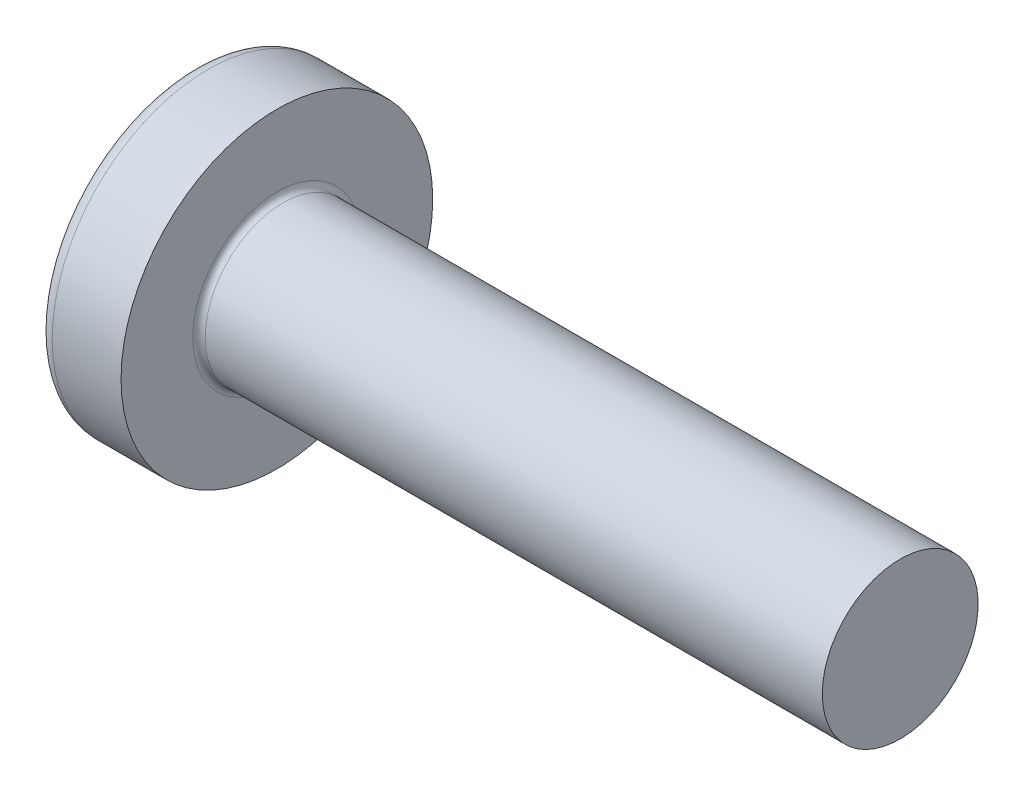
from build123d import *

# Parameters (mm, degrees)
FILLET1_R    = 0.1
RECPAT_COUNT = 2
RECPAT_ANGLE = 90


with BuildPart() as part:
    # BodySke → Base-Revolve (revolve)
    with BuildSketch(Plane.XY, mode=Mode.PRIVATE) as base_revolve_sk:
        with BuildLine():
            Line((2.1, 1.25), (2.1, 2.5))
            Line((2.1, 2.5), (0.99500416, 2.5))
            ThreePointArc((0.99500416, 2.5), (0.88781572, 2.474733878), (0.803195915, 2.404255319))
            ThreePointArc((0.803195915, 2.404255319), (0.206109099, 1.267435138), (0, 0))
            Line((0, 0), (12.1, 0))
            Line((12.1, 0), (12.1, 1.25))
            Line((12.1, 1.25), (2.1, 1.25))
        make_face()
    revolve(base_revolve_sk.sketch.rotate(Axis((0.99500416, 0, 0), (1, 0, 0)), 90), axis=Axis((0.99500416, 0, 0), (1, 0, 0)))

    # Fillet1
    fillet1_edges = [part.edges().sort_by_distance(p)[0] for p in [
        (2.1, 0, -1.25),
    ]]
    fillet(fillet1_edges, radius=FILLET1_R)

    # Sketch3 → Recess section 0
    with BuildSketch(Plane(origin=(0, 0, 0), x_dir=(0, 0, -1), z_dir=(1, 0, 0))):
        with BuildLine():
            Line((0.37, -1.3), (-0.37, -1.3))
            Line((-0.37, -1.3), (-0.37, 1.3))
            Line((-0.37, 1.3), (0.37, 1.3))
            Line((0.37, 1.3), (0.37, -1.3))
        make_face()
    # Sketch4 → Recess section 1
    with BuildSketch(Plane(origin=(1.5, 0, 0), x_dir=(0, 0, -1), z_dir=(1, 0, 0))):
        with BuildLine():
            Line((0.37, -0.552127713), (-0.37, -0.552127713))
            Line((-0.37, -0.552127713), (-0.37, 0.552127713))
            Line((-0.37, 0.552127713), (0.37, 0.552127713))
            Line((0.37, 0.552127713), (0.37, -0.552127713))
        make_face()
    recess = loft(mode=Mode.SUBTRACT)

    # RecPat: Recess ×2 about axis
    recpat_axis = Axis((0, 0, 0), (1, 0, 0))
    for i in range(1, RECPAT_COUNT):
        add(recess.rotate(recpat_axis, i * RECPAT_ANGLE / (RECPAT_COUNT - 1)), mode=Mode.SUBTRACT)

    # RecCorSke → RecessCore (revolve, cut)
    with BuildSketch(Plane.XY, mode=Mode.PRIVATE) as recesscore_sk:
        Polygon((0, 0), (0, 0.660890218), (1.5, 0.556), (1.680655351, 0), align=None)
    revolve(recesscore_sk.sketch.rotate(Axis((-3.175, 0, 0), (1, 0, 0)), 342.85413457), axis=Axis((-3.175, 0, 0), (1, 0, 0)), mode=Mode.SUBTRACT)


solid = part.part
